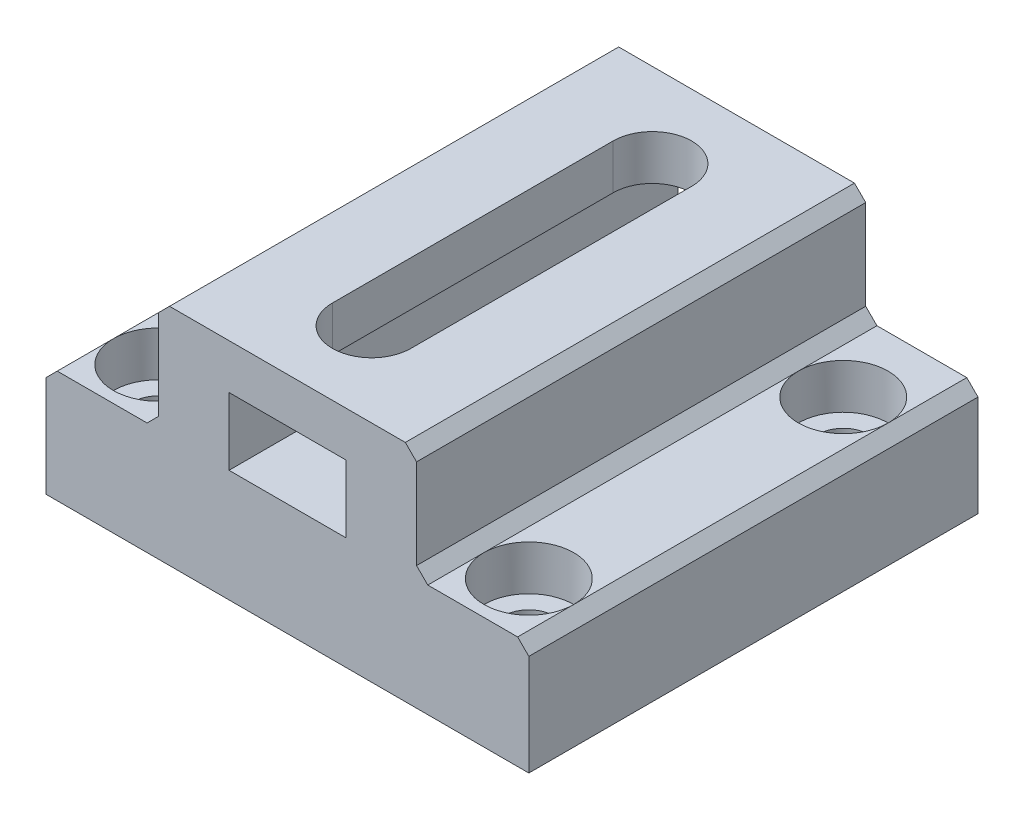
ISO-10303-21;
HEADER;
FILE_DESCRIPTION(('STEP AP214'),'2;1');
FILE_NAME('part.step','',(''),(''),'','','');
FILE_SCHEMA(('AUTOMOTIVE_DESIGN { 1 0 10303 214 1 1 1 1 }'));
ENDSEC;
DATA;
#1=APPLICATION_CONTEXT('core data for automotive mechanical design processes');
#2=APPLICATION_PROTOCOL_DEFINITION('international standard','automotive_design',2000,#1);
#3=PRODUCT_CONTEXT('',#1,'mechanical');
#4=PRODUCT('Part','Part','',(#3));
#5=PRODUCT_RELATED_PRODUCT_CATEGORY('part','',(#4));
#6=PRODUCT_DEFINITION_FORMATION('','',#4);
#7=PRODUCT_DEFINITION_CONTEXT('part definition',#1,'design');
#8=PRODUCT_DEFINITION('design','',#6,#7);
#9=PRODUCT_DEFINITION_SHAPE('','',#8);
#10=(LENGTH_UNIT() NAMED_UNIT(*) SI_UNIT(.MILLI.,.METRE.));
#11=(NAMED_UNIT(*) PLANE_ANGLE_UNIT() SI_UNIT($,.RADIAN.));
#12=(NAMED_UNIT(*) SI_UNIT($,.STERADIAN.) SOLID_ANGLE_UNIT());
#13=UNCERTAINTY_MEASURE_WITH_UNIT(LENGTH_MEASURE(1.E-05),#10,'distance_accuracy_value','');
#14=(GEOMETRIC_REPRESENTATION_CONTEXT(3) GLOBAL_UNCERTAINTY_ASSIGNED_CONTEXT((#13)) GLOBAL_UNIT_ASSIGNED_CONTEXT((#10,
#11,#12)) REPRESENTATION_CONTEXT('',''));
#15=CARTESIAN_POINT('',(0.,0.,0.));
#16=DIRECTION('',(0.,0.,1.));
#17=DIRECTION('',(1.,0.,0.));
#18=AXIS2_PLACEMENT_3D('',#15,#16,#17);
#19=CARTESIAN_POINT('',(21.5,10.,-20.));
#20=DIRECTION('',(0.,1.,0.));
#21=DIRECTION('',(-1.,0.,0.));
#22=AXIS2_PLACEMENT_3D('',#19,#20,#21);
#23=PLANE('',#22);
#24=DIRECTION('',(-1.,0.,0.));
#25=VECTOR('',#24,1.);
#26=CARTESIAN_POINT('',(21.5,10.,-20.));
#27=LINE('',#26,#25);
#28=CARTESIAN_POINT('',(20.5,10.,-20.));
#29=VERTEX_POINT('',#28);
#30=CARTESIAN_POINT('',(12.5,10.,-20.));
#31=VERTEX_POINT('',#30);
#32=EDGE_CURVE('E319',#29,#31,#27,.T.);
#33=ORIENTED_EDGE('',*,*,#32,.T.);
#34=DIRECTION('',(0.,0.,1.));
#35=VECTOR('',#34,1.);
#36=CARTESIAN_POINT('',(12.5,10.,20.));
#37=LINE('',#36,#35);
#38=CARTESIAN_POINT('',(12.5,10.,-13.));
#39=VERTEX_POINT('',#38);
#40=EDGE_CURVE('E433',#31,#39,#37,.T.);
#41=ORIENTED_EDGE('',*,*,#40,.T.);
#42=CARTESIAN_POINT('',(16.5,10.,-13.));
#43=DIRECTION('',(0.,1.,0.));
#44=DIRECTION('',(0.,0.,1.));
#45=AXIS2_PLACEMENT_3D('',#42,#43,#44);
#46=CIRCLE('',#45,4.);
#47=CARTESIAN_POINT('',(20.5,10.,-13.));
#48=VERTEX_POINT('',#47);
#49=EDGE_CURVE('E245',#48,#39,#46,.T.);
#50=ORIENTED_EDGE('',*,*,#49,.F.);
#51=DIRECTION('',(0.,0.,-1.));
#52=VECTOR('',#51,1.);
#53=CARTESIAN_POINT('',(20.5,10.,-20.));
#54=LINE('',#53,#52);
#55=EDGE_CURVE('E423',#48,#29,#54,.T.);
#56=ORIENTED_EDGE('',*,*,#55,.T.);
#57=EDGE_LOOP('',(#33,#41,#50,#56));
#58=FACE_BOUND('',#57,.T.);
#59=ADVANCED_FACE('F34',(#58),#23,.T.);
#60=EDGE_CURVE('E244',#39,#48,#46,.T.);
#61=ORIENTED_EDGE('',*,*,#60,.F.);
#62=DIRECTION('',(0.,0.,1.));
#63=VECTOR('',#62,1.);
#64=CARTESIAN_POINT('',(12.5,10.,20.));
#65=LINE('',#64,#63);
#66=CARTESIAN_POINT('',(12.5,10.,15.));
#67=VERTEX_POINT('',#66);
#68=EDGE_CURVE('E431',#39,#67,#65,.T.);
#69=ORIENTED_EDGE('',*,*,#68,.T.);
#70=CARTESIAN_POINT('',(16.5,10.,15.));
#71=DIRECTION('',(0.,1.,0.));
#72=DIRECTION('',(0.,0.,1.));
#73=AXIS2_PLACEMENT_3D('',#70,#71,#72);
#74=CIRCLE('',#73,4.);
#75=CARTESIAN_POINT('',(20.5,10.,15.));
#76=VERTEX_POINT('',#75);
#77=EDGE_CURVE('E271',#76,#67,#74,.T.);
#78=ORIENTED_EDGE('',*,*,#77,.F.);
#79=DIRECTION('',(0.,0.,-1.));
#80=VECTOR('',#79,1.);
#81=CARTESIAN_POINT('',(20.5,10.,-20.));
#82=LINE('',#81,#80);
#83=EDGE_CURVE('E425',#76,#48,#82,.T.);
#84=ORIENTED_EDGE('',*,*,#83,.T.);
#85=EDGE_LOOP('',(#61,#69,#78,#84));
#86=FACE_BOUND('',#85,.T.);
#87=ADVANCED_FACE('F545',(#86),#23,.T.);
#88=CARTESIAN_POINT('',(-21.5,10.,-20.));
#89=DIRECTION('',(0.,-1.,0.));
#90=DIRECTION('',(1.,0.,0.));
#91=AXIS2_PLACEMENT_3D('',#88,#89,#90);
#92=PLANE('',#91);
#93=DIRECTION('',(1.,0.,0.));
#94=VECTOR('',#93,1.);
#95=CARTESIAN_POINT('',(-21.5,10.,-20.));
#96=LINE('',#95,#94);
#97=CARTESIAN_POINT('',(-20.5,10.,-20.));
#98=VERTEX_POINT('',#97);
#99=CARTESIAN_POINT('',(-12.5,10.,-20.));
#100=VERTEX_POINT('',#99);
#101=EDGE_CURVE('E328',#98,#100,#96,.T.);
#102=ORIENTED_EDGE('',*,*,#101,.F.);
#103=DIRECTION('',(0.,0.,1.));
#104=VECTOR('',#103,1.);
#105=CARTESIAN_POINT('',(-20.5,10.,-20.));
#106=LINE('',#105,#104);
#107=CARTESIAN_POINT('',(-20.5,10.,-13.));
#108=VERTEX_POINT('',#107);
#109=EDGE_CURVE('E387',#98,#108,#106,.T.);
#110=ORIENTED_EDGE('',*,*,#109,.T.);
#111=CARTESIAN_POINT('',(-16.5,10.,-13.));
#112=DIRECTION('',(0.,1.,0.));
#113=DIRECTION('',(0.,0.,1.));
#114=AXIS2_PLACEMENT_3D('',#111,#112,#113);
#115=CIRCLE('',#114,4.);
#116=CARTESIAN_POINT('',(-12.5,10.,-13.));
#117=VERTEX_POINT('',#116);
#118=EDGE_CURVE('E232',#117,#108,#115,.T.);
#119=ORIENTED_EDGE('',*,*,#118,.F.);
#120=DIRECTION('',(0.,0.,-1.));
#121=VECTOR('',#120,1.);
#122=CARTESIAN_POINT('',(-12.5,10.,-20.));
#123=LINE('',#122,#121);
#124=EDGE_CURVE('E377',#117,#100,#123,.T.);
#125=ORIENTED_EDGE('',*,*,#124,.T.);
#126=EDGE_LOOP('',(#102,#110,#119,#125));
#127=FACE_BOUND('',#126,.T.);
#128=ADVANCED_FACE('F493',(#127),#92,.F.);
#129=EDGE_CURVE('E231',#108,#117,#115,.T.);
#130=ORIENTED_EDGE('',*,*,#129,.F.);
#131=DIRECTION('',(0.,0.,1.));
#132=VECTOR('',#131,1.);
#133=CARTESIAN_POINT('',(-20.5,10.,-20.));
#134=LINE('',#133,#132);
#135=CARTESIAN_POINT('',(-20.5,10.,15.));
#136=VERTEX_POINT('',#135);
#137=EDGE_CURVE('E385',#108,#136,#134,.T.);
#138=ORIENTED_EDGE('',*,*,#137,.T.);
#139=CARTESIAN_POINT('',(-16.5,10.,15.));
#140=DIRECTION('',(0.,1.,0.));
#141=DIRECTION('',(0.,0.,1.));
#142=AXIS2_PLACEMENT_3D('',#139,#140,#141);
#143=CIRCLE('',#142,4.);
#144=CARTESIAN_POINT('',(-12.5,10.,15.));
#145=VERTEX_POINT('',#144);
#146=EDGE_CURVE('E258',#145,#136,#143,.T.);
#147=ORIENTED_EDGE('',*,*,#146,.F.);
#148=DIRECTION('',(0.,0.,-1.));
#149=VECTOR('',#148,1.);
#150=CARTESIAN_POINT('',(-12.5,10.,-20.));
#151=LINE('',#150,#149);
#152=EDGE_CURVE('E379',#145,#117,#151,.T.);
#153=ORIENTED_EDGE('',*,*,#152,.T.);
#154=EDGE_LOOP('',(#130,#138,#147,#153));
#155=FACE_BOUND('',#154,.T.);
#156=ADVANCED_FACE('F526',(#155),#92,.F.);
#157=CARTESIAN_POINT('',(21.5,20.,-20.));
#158=DIRECTION('',(-1.,0.,0.));
#159=DIRECTION('',(0.,0.,1.));
#160=AXIS2_PLACEMENT_3D('',#157,#158,#159);
#161=PLANE('',#160);
#162=DIRECTION('',(0.,-1.,0.));
#163=VECTOR('',#162,1.);
#164=CARTESIAN_POINT('',(21.5,20.,-20.));
#165=LINE('',#164,#163);
#166=CARTESIAN_POINT('',(21.5,9.00000000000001,-20.));
#167=VERTEX_POINT('',#166);
#168=CARTESIAN_POINT('',(21.5,0.,-20.));
#169=VERTEX_POINT('',#168);
#170=EDGE_CURVE('E363',#167,#169,#165,.T.);
#171=ORIENTED_EDGE('',*,*,#170,.F.);
#172=DIRECTION('',(0.,0.,1.));
#173=VECTOR('',#172,1.);
#174=CARTESIAN_POINT('',(21.5,9.00000000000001,20.));
#175=LINE('',#174,#173);
#176=CARTESIAN_POINT('',(21.5,9.00000000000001,20.));
#177=VERTEX_POINT('',#176);
#178=EDGE_CURVE('E436',#167,#177,#175,.T.);
#179=ORIENTED_EDGE('',*,*,#178,.T.);
#180=DIRECTION('',(0.,-1.,0.));
#181=VECTOR('',#180,1.);
#182=CARTESIAN_POINT('',(21.5,20.,20.));
#183=LINE('',#182,#181);
#184=CARTESIAN_POINT('',(21.5,0.,20.));
#185=VERTEX_POINT('',#184);
#186=EDGE_CURVE('E347',#177,#185,#183,.T.);
#187=ORIENTED_EDGE('',*,*,#186,.T.);
#188=DIRECTION('',(0.,0.,-1.));
#189=VECTOR('',#188,1.);
#190=CARTESIAN_POINT('',(21.5,0.,-20.));
#191=LINE('',#190,#189);
#192=EDGE_CURVE('E335',#185,#169,#191,.T.);
#193=ORIENTED_EDGE('',*,*,#192,.T.);
#194=EDGE_LOOP('',(#171,#179,#187,#193));
#195=FACE_BOUND('',#194,.T.);
#196=ADVANCED_FACE('F471',(#195),#161,.F.);
#197=CARTESIAN_POINT('',(-21.5,20.,-20.));
#198=DIRECTION('',(0.,0.,1.));
#199=DIRECTION('',(1.,0.,0.));
#200=AXIS2_PLACEMENT_3D('',#197,#198,#199);
#201=PLANE('',#200);
#202=DIRECTION('',(-1.,0.,0.));
#203=VECTOR('',#202,1.);
#204=CARTESIAN_POINT('',(-21.5,0.,-20.));
#205=LINE('',#204,#203);
#206=CARTESIAN_POINT('',(-21.5,0.,-20.));
#207=VERTEX_POINT('',#206);
#208=EDGE_CURVE('E350',#169,#207,#205,.T.);
#209=ORIENTED_EDGE('',*,*,#208,.T.);
#210=DIRECTION('',(0.,-1.,0.));
#211=VECTOR('',#210,1.);
#212=CARTESIAN_POINT('',(-21.5,20.,-20.));
#213=LINE('',#212,#211);
#214=CARTESIAN_POINT('',(-21.5,9.00000000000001,-20.));
#215=VERTEX_POINT('',#214);
#216=EDGE_CURVE('E360',#215,#207,#213,.T.);
#217=ORIENTED_EDGE('',*,*,#216,.F.);
#218=DIRECTION('',(-0.707106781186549,-0.707106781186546,0.));
#219=VECTOR('',#218,1.);
#220=CARTESIAN_POINT('',(-20.5,10.,-20.));
#221=LINE('',#220,#219);
#222=EDGE_CURVE('E406',#215,#98,#221,.F.);
#223=ORIENTED_EDGE('',*,*,#222,.T.);
#224=ORIENTED_EDGE('',*,*,#101,.T.);
#225=DIRECTION('',(-0.707106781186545,-0.70710678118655,0.));
#226=VECTOR('',#225,1.);
#227=CARTESIAN_POINT('',(-12.,10.5,-20.));
#228=LINE('',#227,#226);
#229=CARTESIAN_POINT('',(-11.5,11.,-20.));
#230=VERTEX_POINT('',#229);
#231=EDGE_CURVE('E441',#100,#230,#228,.F.);
#232=ORIENTED_EDGE('',*,*,#231,.T.);
#233=DIRECTION('',(0.,1.,0.));
#234=VECTOR('',#233,1.);
#235=CARTESIAN_POINT('',(-11.5,20.,-20.));
#236=LINE('',#235,#234);
#237=CARTESIAN_POINT('',(-11.5,19.,-20.));
#238=VERTEX_POINT('',#237);
#239=EDGE_CURVE('E331',#230,#238,#236,.T.);
#240=ORIENTED_EDGE('',*,*,#239,.T.);
#241=DIRECTION('',(0.707106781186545,0.70710678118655,0.));
#242=VECTOR('',#241,1.);
#243=CARTESIAN_POINT('',(-10.5,20.,-20.));
#244=LINE('',#243,#242);
#245=CARTESIAN_POINT('',(-10.5,20.,-20.));
#246=VERTEX_POINT('',#245);
#247=EDGE_CURVE('E404',#238,#246,#244,.T.);
#248=ORIENTED_EDGE('',*,*,#247,.T.);
#249=DIRECTION('',(-1.,0.,0.));
#250=VECTOR('',#249,1.);
#251=CARTESIAN_POINT('',(-21.5,20.,-20.));
#252=LINE('',#251,#250);
#253=CARTESIAN_POINT('',(10.5,20.,-20.));
#254=VERTEX_POINT('',#253);
#255=EDGE_CURVE('E340',#254,#246,#252,.T.);
#256=ORIENTED_EDGE('',*,*,#255,.F.);
#257=DIRECTION('',(-0.707106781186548,0.707106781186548,0.));
#258=VECTOR('',#257,1.);
#259=CARTESIAN_POINT('',(11.5,19.,-20.));
#260=LINE('',#259,#258);
#261=CARTESIAN_POINT('',(11.5,19.,-20.));
#262=VERTEX_POINT('',#261);
#263=EDGE_CURVE('E402',#254,#262,#260,.F.);
#264=ORIENTED_EDGE('',*,*,#263,.T.);
#265=DIRECTION('',(0.,1.,0.));
#266=VECTOR('',#265,1.);
#267=CARTESIAN_POINT('',(11.5,20.,-20.));
#268=LINE('',#267,#266);
#269=CARTESIAN_POINT('',(11.5,11.,-20.));
#270=VERTEX_POINT('',#269);
#271=EDGE_CURVE('E316',#270,#262,#268,.T.);
#272=ORIENTED_EDGE('',*,*,#271,.F.);
#273=DIRECTION('',(-0.70710678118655,0.707106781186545,0.));
#274=VECTOR('',#273,1.);
#275=CARTESIAN_POINT('',(-9.50000000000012,32.,-20.));
#276=LINE('',#275,#274);
#277=EDGE_CURVE('E11',#270,#31,#276,.F.);
#278=ORIENTED_EDGE('',*,*,#277,.T.);
#279=ORIENTED_EDGE('',*,*,#32,.F.);
#280=DIRECTION('',(0.707106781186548,-0.707106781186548,0.));
#281=VECTOR('',#280,1.);
#282=CARTESIAN_POINT('',(21.5,9.00000000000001,-20.));
#283=LINE('',#282,#281);
#284=EDGE_CURVE('E400',#29,#167,#283,.T.);
#285=ORIENTED_EDGE('',*,*,#284,.T.);
#286=ORIENTED_EDGE('',*,*,#170,.T.);
#287=EDGE_LOOP('',(#209,#217,#223,#224,#232,#240,#248,#256,#264,#272,#278,#279,#285,#286));
#288=FACE_BOUND('',#287,.T.);
#289=DIRECTION('',(0.,-1.,0.));
#290=VECTOR('',#289,1.);
#291=CARTESIAN_POINT('',(-5.2,0.,-20.));
#292=LINE('',#291,#290);
#293=CARTESIAN_POINT('',(-5.2,16.,-20.));
#294=VERTEX_POINT('',#293);
#295=CARTESIAN_POINT('',(-5.2,10.,-20.));
#296=VERTEX_POINT('',#295);
#297=EDGE_CURVE('E303',#294,#296,#292,.T.);
#298=ORIENTED_EDGE('',*,*,#297,.T.);
#299=DIRECTION('',(-1.,0.,0.));
#300=VECTOR('',#299,1.);
#301=CARTESIAN_POINT('',(-5.20607799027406,10.,-20.));
#302=LINE('',#301,#300);
#303=CARTESIAN_POINT('',(5.2,10.,-20.));
#304=VERTEX_POINT('',#303);
#305=EDGE_CURVE('E224',#304,#296,#302,.T.);
#306=ORIENTED_EDGE('',*,*,#305,.F.);
#307=DIRECTION('',(0.,1.,0.));
#308=VECTOR('',#307,1.);
#309=CARTESIAN_POINT('',(5.2,0.,-20.));
#310=LINE('',#309,#308);
#311=CARTESIAN_POINT('',(5.2,16.,-20.));
#312=VERTEX_POINT('',#311);
#313=EDGE_CURVE('E220',#304,#312,#310,.T.);
#314=ORIENTED_EDGE('',*,*,#313,.T.);
#315=DIRECTION('',(-1.,0.,0.));
#316=VECTOR('',#315,1.);
#317=CARTESIAN_POINT('',(-5.2,16.,-20.));
#318=LINE('',#317,#316);
#319=EDGE_CURVE('E306',#312,#294,#318,.T.);
#320=ORIENTED_EDGE('',*,*,#319,.T.);
#321=EDGE_LOOP('',(#298,#306,#314,#320));
#322=FACE_BOUND('',#321,.T.);
#323=ADVANCED_FACE('F457',(#288,#322),#201,.F.);
#324=CARTESIAN_POINT('',(-21.5,20.,20.));
#325=DIRECTION('',(0.,0.,-1.));
#326=DIRECTION('',(-1.,0.,0.));
#327=AXIS2_PLACEMENT_3D('',#324,#325,#326);
#328=PLANE('',#327);
#329=DIRECTION('',(-1.,0.,0.));
#330=VECTOR('',#329,1.);
#331=CARTESIAN_POINT('',(-5.20607799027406,10.,20.));
#332=LINE('',#331,#330);
#333=CARTESIAN_POINT('',(5.2,10.,20.));
#334=VERTEX_POINT('',#333);
#335=CARTESIAN_POINT('',(-5.2,10.,20.));
#336=VERTEX_POINT('',#335);
#337=EDGE_CURVE('E210',#334,#336,#332,.T.);
#338=ORIENTED_EDGE('',*,*,#337,.T.);
#339=DIRECTION('',(0.,-1.,0.));
#340=VECTOR('',#339,1.);
#341=CARTESIAN_POINT('',(-5.2,0.,20.));
#342=LINE('',#341,#340);
#343=CARTESIAN_POINT('',(-5.2,16.,20.));
#344=VERTEX_POINT('',#343);
#345=EDGE_CURVE('E54',#344,#336,#342,.T.);
#346=ORIENTED_EDGE('',*,*,#345,.F.);
#347=DIRECTION('',(-1.,0.,0.));
#348=VECTOR('',#347,1.);
#349=CARTESIAN_POINT('',(-5.2,16.,20.));
#350=LINE('',#349,#348);
#351=CARTESIAN_POINT('',(5.2,16.,20.));
#352=VERTEX_POINT('',#351);
#353=EDGE_CURVE('E212',#352,#344,#350,.T.);
#354=ORIENTED_EDGE('',*,*,#353,.F.);
#355=DIRECTION('',(0.,1.,0.));
#356=VECTOR('',#355,1.);
#357=CARTESIAN_POINT('',(5.2,0.,20.));
#358=LINE('',#357,#356);
#359=EDGE_CURVE('E205',#334,#352,#358,.T.);
#360=ORIENTED_EDGE('',*,*,#359,.F.);
#361=EDGE_LOOP('',(#338,#346,#354,#360));
#362=FACE_BOUND('',#361,.T.);
#363=DIRECTION('',(1.,0.,0.));
#364=VECTOR('',#363,1.);
#365=CARTESIAN_POINT('',(-21.5,0.,20.));
#366=LINE('',#365,#364);
#367=CARTESIAN_POINT('',(-21.5,0.,20.));
#368=VERTEX_POINT('',#367);
#369=EDGE_CURVE('E344',#368,#185,#366,.T.);
#370=ORIENTED_EDGE('',*,*,#369,.T.);
#371=ORIENTED_EDGE('',*,*,#186,.F.);
#372=DIRECTION('',(-0.707106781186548,0.707106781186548,0.));
#373=VECTOR('',#372,1.);
#374=CARTESIAN_POINT('',(21.5,9.00000000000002,20.));
#375=LINE('',#374,#373);
#376=CARTESIAN_POINT('',(20.5,10.,20.));
#377=VERTEX_POINT('',#376);
#378=EDGE_CURVE('E390',#177,#377,#375,.T.);
#379=ORIENTED_EDGE('',*,*,#378,.T.);
#380=DIRECTION('',(-1.,0.,0.));
#381=VECTOR('',#380,1.);
#382=CARTESIAN_POINT('',(21.5,10.,20.));
#383=LINE('',#382,#381);
#384=CARTESIAN_POINT('',(12.5,10.,20.));
#385=VERTEX_POINT('',#384);
#386=EDGE_CURVE('E320',#377,#385,#383,.T.);
#387=ORIENTED_EDGE('',*,*,#386,.T.);
#388=DIRECTION('',(0.70710678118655,-0.707106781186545,0.));
#389=VECTOR('',#388,1.);
#390=CARTESIAN_POINT('',(-9.50000000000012,32.,20.));
#391=LINE('',#390,#389);
#392=CARTESIAN_POINT('',(11.5,11.,20.));
#393=VERTEX_POINT('',#392);
#394=EDGE_CURVE('E42',#385,#393,#391,.F.);
#395=ORIENTED_EDGE('',*,*,#394,.T.);
#396=DIRECTION('',(0.,1.,0.));
#397=VECTOR('',#396,1.);
#398=CARTESIAN_POINT('',(11.5,20.,20.));
#399=LINE('',#398,#397);
#400=CARTESIAN_POINT('',(11.5,19.,20.));
#401=VERTEX_POINT('',#400);
#402=EDGE_CURVE('E314',#393,#401,#399,.T.);
#403=ORIENTED_EDGE('',*,*,#402,.T.);
#404=DIRECTION('',(0.707106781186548,-0.707106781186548,0.));
#405=VECTOR('',#404,1.);
#406=CARTESIAN_POINT('',(11.5,19.,20.));
#407=LINE('',#406,#405);
#408=CARTESIAN_POINT('',(10.5,20.,20.));
#409=VERTEX_POINT('',#408);
#410=EDGE_CURVE('E392',#401,#409,#407,.F.);
#411=ORIENTED_EDGE('',*,*,#410,.T.);
#412=DIRECTION('',(1.,0.,0.));
#413=VECTOR('',#412,1.);
#414=CARTESIAN_POINT('',(-21.5,20.,20.));
#415=LINE('',#414,#413);
#416=CARTESIAN_POINT('',(-10.5,20.,20.));
#417=VERTEX_POINT('',#416);
#418=EDGE_CURVE('E343',#417,#409,#415,.T.);
#419=ORIENTED_EDGE('',*,*,#418,.F.);
#420=DIRECTION('',(-0.707106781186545,-0.70710678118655,0.));
#421=VECTOR('',#420,1.);
#422=CARTESIAN_POINT('',(-10.5,20.,20.));
#423=LINE('',#422,#421);
#424=CARTESIAN_POINT('',(-11.5,19.,20.));
#425=VERTEX_POINT('',#424);
#426=EDGE_CURVE('E394',#417,#425,#423,.T.);
#427=ORIENTED_EDGE('',*,*,#426,.T.);
#428=DIRECTION('',(0.,1.,0.));
#429=VECTOR('',#428,1.);
#430=CARTESIAN_POINT('',(-11.5,20.,20.));
#431=LINE('',#430,#429);
#432=CARTESIAN_POINT('',(-11.5,11.,20.));
#433=VERTEX_POINT('',#432);
#434=EDGE_CURVE('E332',#433,#425,#431,.T.);
#435=ORIENTED_EDGE('',*,*,#434,.F.);
#436=DIRECTION('',(0.707106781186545,0.70710678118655,0.));
#437=VECTOR('',#436,1.);
#438=CARTESIAN_POINT('',(-12.,10.5,20.));
#439=LINE('',#438,#437);
#440=CARTESIAN_POINT('',(-12.5,10.,20.));
#441=VERTEX_POINT('',#440);
#442=EDGE_CURVE('E439',#433,#441,#439,.F.);
#443=ORIENTED_EDGE('',*,*,#442,.T.);
#444=DIRECTION('',(1.,0.,0.));
#445=VECTOR('',#444,1.);
#446=CARTESIAN_POINT('',(-21.5,10.,20.));
#447=LINE('',#446,#445);
#448=CARTESIAN_POINT('',(-20.5,10.,20.));
#449=VERTEX_POINT('',#448);
#450=EDGE_CURVE('E323',#449,#441,#447,.T.);
#451=ORIENTED_EDGE('',*,*,#450,.F.);
#452=DIRECTION('',(0.707106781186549,0.707106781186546,0.));
#453=VECTOR('',#452,1.);
#454=CARTESIAN_POINT('',(-20.5,10.,20.));
#455=LINE('',#454,#453);
#456=CARTESIAN_POINT('',(-21.5,9.00000000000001,20.));
#457=VERTEX_POINT('',#456);
#458=EDGE_CURVE('E396',#449,#457,#455,.F.);
#459=ORIENTED_EDGE('',*,*,#458,.T.);
#460=DIRECTION('',(0.,-1.,0.));
#461=VECTOR('',#460,1.);
#462=CARTESIAN_POINT('',(-21.5,20.,20.));
#463=LINE('',#462,#461);
#464=EDGE_CURVE('E358',#457,#368,#463,.T.);
#465=ORIENTED_EDGE('',*,*,#464,.T.);
#466=EDGE_LOOP('',(#370,#371,#379,#387,#395,#403,#411,#419,#427,#435,#443,#451,#459,#465));
#467=FACE_BOUND('',#466,.T.);
#468=ADVANCED_FACE('F207',(#362,#467),#328,.F.);
#469=CARTESIAN_POINT('',(0.,20.,0.));
#470=DIRECTION('',(0.,1.,0.));
#471=DIRECTION('',(0.,0.,1.));
#472=AXIS2_PLACEMENT_3D('',#469,#470,#471);
#473=PLANE('',#472);
#474=CARTESIAN_POINT('',(0.,20.,12.5));
#475=DIRECTION('',(0.,1.,0.));
#476=DIRECTION('',(0.,0.,1.));
#477=AXIS2_PLACEMENT_3D('',#474,#475,#476);
#478=CIRCLE('',#477,3.5);
#479=CARTESIAN_POINT('',(-3.5,20.,12.5));
#480=VERTEX_POINT('',#479);
#481=CARTESIAN_POINT('',(3.5,20.,12.5));
#482=VERTEX_POINT('',#481);
#483=EDGE_CURVE('E283',#480,#482,#478,.T.);
#484=ORIENTED_EDGE('',*,*,#483,.F.);
#485=DIRECTION('',(0.,0.,1.));
#486=VECTOR('',#485,1.);
#487=CARTESIAN_POINT('',(-3.5,20.,12.5));
#488=LINE('',#487,#486);
#489=CARTESIAN_POINT('',(-3.5,20.,-12.5));
#490=VERTEX_POINT('',#489);
#491=EDGE_CURVE('E291',#490,#480,#488,.T.);
#492=ORIENTED_EDGE('',*,*,#491,.F.);
#493=CARTESIAN_POINT('',(0.,20.,-12.5));
#494=DIRECTION('',(0.,1.,0.));
#495=DIRECTION('',(0.,0.,1.));
#496=AXIS2_PLACEMENT_3D('',#493,#494,#495);
#497=CIRCLE('',#496,3.5);
#498=CARTESIAN_POINT('',(3.5,20.,-12.5));
#499=VERTEX_POINT('',#498);
#500=EDGE_CURVE('E288',#499,#490,#497,.T.);
#501=ORIENTED_EDGE('',*,*,#500,.F.);
#502=DIRECTION('',(0.,0.,-1.));
#503=VECTOR('',#502,1.);
#504=CARTESIAN_POINT('',(3.5,20.,12.5));
#505=LINE('',#504,#503);
#506=EDGE_CURVE('E285',#482,#499,#505,.T.);
#507=ORIENTED_EDGE('',*,*,#506,.F.);
#508=EDGE_LOOP('',(#484,#492,#501,#507));
#509=FACE_BOUND('',#508,.T.);
#510=ORIENTED_EDGE('',*,*,#255,.T.);
#511=DIRECTION('',(0.,0.,1.));
#512=VECTOR('',#511,1.);
#513=CARTESIAN_POINT('',(-10.5,20.,20.));
#514=LINE('',#513,#512);
#515=EDGE_CURVE('E415',#246,#417,#514,.T.);
#516=ORIENTED_EDGE('',*,*,#515,.T.);
#517=ORIENTED_EDGE('',*,*,#418,.T.);
#518=DIRECTION('',(0.,0.,-1.));
#519=VECTOR('',#518,1.);
#520=CARTESIAN_POINT('',(10.5,20.,0.));
#521=LINE('',#520,#519);
#522=EDGE_CURVE('E413',#409,#254,#521,.T.);
#523=ORIENTED_EDGE('',*,*,#522,.T.);
#524=EDGE_LOOP('',(#510,#516,#517,#523));
#525=FACE_BOUND('',#524,.T.);
#526=ADVANCED_FACE('F514',(#509,#525),#473,.T.);
#527=CARTESIAN_POINT('',(-21.5,20.,-20.));
#528=DIRECTION('',(1.,0.,0.));
#529=DIRECTION('',(0.,0.,-1.));
#530=AXIS2_PLACEMENT_3D('',#527,#528,#529);
#531=PLANE('',#530);
#532=ORIENTED_EDGE('',*,*,#464,.F.);
#533=DIRECTION('',(0.,0.,-1.));
#534=VECTOR('',#533,1.);
#535=CARTESIAN_POINT('',(-21.5,9.00000000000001,-20.));
#536=LINE('',#535,#534);
#537=EDGE_CURVE('E398',#457,#215,#536,.T.);
#538=ORIENTED_EDGE('',*,*,#537,.T.);
#539=ORIENTED_EDGE('',*,*,#216,.T.);
#540=DIRECTION('',(0.,0.,1.));
#541=VECTOR('',#540,1.);
#542=CARTESIAN_POINT('',(-21.5,0.,-20.));
#543=LINE('',#542,#541);
#544=EDGE_CURVE('E352',#207,#368,#543,.T.);
#545=ORIENTED_EDGE('',*,*,#544,.T.);
#546=EDGE_LOOP('',(#532,#538,#539,#545));
#547=FACE_BOUND('',#546,.T.);
#548=ADVANCED_FACE('F483',(#547),#531,.F.);
#549=CARTESIAN_POINT('',(0.,0.,0.));
#550=DIRECTION('',(0.,1.,0.));
#551=DIRECTION('',(0.,0.,1.));
#552=AXIS2_PLACEMENT_3D('',#549,#550,#551);
#553=PLANE('',#552);
#554=CARTESIAN_POINT('',(16.5,0.,-13.));
#555=DIRECTION('',(0.,1.,0.));
#556=DIRECTION('',(0.,0.,1.));
#557=AXIS2_PLACEMENT_3D('',#554,#555,#556);
#558=CIRCLE('',#557,2.25);
#559=CARTESIAN_POINT('',(16.5,0.,-10.75));
#560=VERTEX_POINT('',#559);
#561=EDGE_CURVE('E254',#560,#560,#558,.T.);
#562=ORIENTED_EDGE('',*,*,#561,.T.);
#563=EDGE_LOOP('',(#562));
#564=FACE_BOUND('',#563,.T.);
#565=CARTESIAN_POINT('',(16.5,0.,15.));
#566=DIRECTION('',(0.,1.,0.));
#567=DIRECTION('',(0.,0.,1.));
#568=AXIS2_PLACEMENT_3D('',#565,#566,#567);
#569=CIRCLE('',#568,2.25);
#570=CARTESIAN_POINT('',(16.5,0.,17.25));
#571=VERTEX_POINT('',#570);
#572=EDGE_CURVE('E280',#571,#571,#569,.T.);
#573=ORIENTED_EDGE('',*,*,#572,.T.);
#574=EDGE_LOOP('',(#573));
#575=FACE_BOUND('',#574,.T.);
#576=ORIENTED_EDGE('',*,*,#192,.F.);
#577=ORIENTED_EDGE('',*,*,#369,.F.);
#578=ORIENTED_EDGE('',*,*,#544,.F.);
#579=ORIENTED_EDGE('',*,*,#208,.F.);
#580=EDGE_LOOP('',(#576,#577,#578,#579));
#581=FACE_BOUND('',#580,.T.);
#582=CARTESIAN_POINT('',(-16.5,0.,-13.));
#583=DIRECTION('',(0.,1.,0.));
#584=DIRECTION('',(0.,0.,1.));
#585=AXIS2_PLACEMENT_3D('',#582,#583,#584);
#586=CIRCLE('',#585,2.25);
#587=CARTESIAN_POINT('',(-16.5,0.,-10.75));
#588=VERTEX_POINT('',#587);
#589=EDGE_CURVE('E241',#588,#588,#586,.T.);
#590=ORIENTED_EDGE('',*,*,#589,.T.);
#591=EDGE_LOOP('',(#590));
#592=FACE_BOUND('',#591,.T.);
#593=CARTESIAN_POINT('',(-16.5,0.,15.));
#594=DIRECTION('',(0.,1.,0.));
#595=DIRECTION('',(0.,0.,1.));
#596=AXIS2_PLACEMENT_3D('',#593,#594,#595);
#597=CIRCLE('',#596,2.25);
#598=CARTESIAN_POINT('',(-16.5,0.,17.25));
#599=VERTEX_POINT('',#598);
#600=EDGE_CURVE('E267',#599,#599,#597,.T.);
#601=ORIENTED_EDGE('',*,*,#600,.T.);
#602=EDGE_LOOP('',(#601));
#603=FACE_BOUND('',#602,.T.);
#604=ADVANCED_FACE('F476',(#564,#575,#581,#592,#603),#553,.F.);
#605=CARTESIAN_POINT('',(-11.5,20.,-20.));
#606=DIRECTION('',(1.,0.,0.));
#607=DIRECTION('',(0.,1.,0.));
#608=AXIS2_PLACEMENT_3D('',#605,#606,#607);
#609=PLANE('',#608);
#610=ORIENTED_EDGE('',*,*,#239,.F.);
#611=DIRECTION('',(0.,0.,1.));
#612=VECTOR('',#611,1.);
#613=CARTESIAN_POINT('',(-11.5,11.,20.));
#614=LINE('',#613,#612);
#615=EDGE_CURVE('E410',#230,#433,#614,.T.);
#616=ORIENTED_EDGE('',*,*,#615,.T.);
#617=ORIENTED_EDGE('',*,*,#434,.T.);
#618=DIRECTION('',(0.,0.,-1.));
#619=VECTOR('',#618,1.);
#620=CARTESIAN_POINT('',(-11.5,19.,-20.));
#621=LINE('',#620,#619);
#622=EDGE_CURVE('E408',#425,#238,#621,.T.);
#623=ORIENTED_EDGE('',*,*,#622,.T.);
#624=EDGE_LOOP('',(#610,#616,#617,#623));
#625=FACE_BOUND('',#624,.T.);
#626=ADVANCED_FACE('F505',(#625),#609,.F.);
#627=EDGE_CURVE('E257',#136,#145,#143,.T.);
#628=ORIENTED_EDGE('',*,*,#627,.F.);
#629=DIRECTION('',(0.,0.,1.));
#630=VECTOR('',#629,1.);
#631=CARTESIAN_POINT('',(-20.5,10.,-20.));
#632=LINE('',#631,#630);
#633=EDGE_CURVE('E383',#136,#449,#632,.T.);
#634=ORIENTED_EDGE('',*,*,#633,.T.);
#635=ORIENTED_EDGE('',*,*,#450,.T.);
#636=DIRECTION('',(0.,0.,-1.));
#637=VECTOR('',#636,1.);
#638=CARTESIAN_POINT('',(-12.5,10.,-20.));
#639=LINE('',#638,#637);
#640=EDGE_CURVE('E381',#441,#145,#639,.T.);
#641=ORIENTED_EDGE('',*,*,#640,.T.);
#642=EDGE_LOOP('',(#628,#634,#635,#641));
#643=FACE_BOUND('',#642,.T.);
#644=ADVANCED_FACE('F522',(#643),#92,.F.);
#645=EDGE_CURVE('E270',#67,#76,#74,.T.);
#646=ORIENTED_EDGE('',*,*,#645,.F.);
#647=DIRECTION('',(0.,0.,1.));
#648=VECTOR('',#647,1.);
#649=CARTESIAN_POINT('',(12.5,10.,20.));
#650=LINE('',#649,#648);
#651=EDGE_CURVE('E429',#67,#385,#650,.T.);
#652=ORIENTED_EDGE('',*,*,#651,.T.);
#653=ORIENTED_EDGE('',*,*,#386,.F.);
#654=DIRECTION('',(0.,0.,-1.));
#655=VECTOR('',#654,1.);
#656=CARTESIAN_POINT('',(20.5,10.,-20.));
#657=LINE('',#656,#655);
#658=EDGE_CURVE('E427',#377,#76,#657,.T.);
#659=ORIENTED_EDGE('',*,*,#658,.T.);
#660=EDGE_LOOP('',(#646,#652,#653,#659));
#661=FACE_BOUND('',#660,.T.);
#662=ADVANCED_FACE('F547',(#661),#23,.T.);
#663=CARTESIAN_POINT('',(11.5,20.,-20.));
#664=DIRECTION('',(1.,0.,0.));
#665=DIRECTION('',(0.,1.,0.));
#666=AXIS2_PLACEMENT_3D('',#663,#664,#665);
#667=PLANE('',#666);
#668=ORIENTED_EDGE('',*,*,#271,.T.);
#669=DIRECTION('',(0.,0.,1.));
#670=VECTOR('',#669,1.);
#671=CARTESIAN_POINT('',(11.5,19.,-20.));
#672=LINE('',#671,#670);
#673=EDGE_CURVE('E420',#262,#401,#672,.T.);
#674=ORIENTED_EDGE('',*,*,#673,.T.);
#675=ORIENTED_EDGE('',*,*,#402,.F.);
#676=DIRECTION('',(0.,0.,-1.));
#677=VECTOR('',#676,1.);
#678=CARTESIAN_POINT('',(11.5,11.,-20.));
#679=LINE('',#678,#677);
#680=EDGE_CURVE('E418',#393,#270,#679,.T.);
#681=ORIENTED_EDGE('',*,*,#680,.T.);
#682=EDGE_LOOP('',(#668,#674,#675,#681));
#683=FACE_BOUND('',#682,.T.);
#684=ADVANCED_FACE('F449',(#683),#667,.T.);
#685=CARTESIAN_POINT('',(-5.2,0.,-20.));
#686=DIRECTION('',(-1.,0.,0.));
#687=DIRECTION('',(0.,-1.,0.));
#688=AXIS2_PLACEMENT_3D('',#685,#686,#687);
#689=PLANE('',#688);
#690=ORIENTED_EDGE('',*,*,#345,.T.);
#691=DIRECTION('',(0.,0.,-1.));
#692=VECTOR('',#691,1.);
#693=CARTESIAN_POINT('',(-5.2,10.,-20.));
#694=LINE('',#693,#692);
#695=EDGE_CURVE('E49',#336,#296,#694,.T.);
#696=ORIENTED_EDGE('',*,*,#695,.T.);
#697=ORIENTED_EDGE('',*,*,#297,.F.);
#698=DIRECTION('',(0.,0.,1.));
#699=VECTOR('',#698,1.);
#700=CARTESIAN_POINT('',(-5.2,16.,-20.));
#701=LINE('',#700,#699);
#702=EDGE_CURVE('E312',#294,#344,#701,.T.);
#703=ORIENTED_EDGE('',*,*,#702,.T.);
#704=EDGE_LOOP('',(#690,#696,#697,#703));
#705=FACE_BOUND('',#704,.T.);
#706=ADVANCED_FACE('F560',(#705),#689,.F.);
#707=CARTESIAN_POINT('',(-5.2,16.,-20.));
#708=DIRECTION('',(0.,1.,0.));
#709=DIRECTION('',(0.,0.,1.));
#710=AXIS2_PLACEMENT_3D('',#707,#708,#709);
#711=PLANE('',#710);
#712=DIRECTION('',(0.,0.,1.));
#713=VECTOR('',#712,1.);
#714=CARTESIAN_POINT('',(-3.5,16.,-20.));
#715=LINE('',#714,#713);
#716=CARTESIAN_POINT('',(-3.5,16.,-12.5));
#717=VERTEX_POINT('',#716);
#718=CARTESIAN_POINT('',(-3.5,16.,12.5));
#719=VERTEX_POINT('',#718);
#720=EDGE_CURVE('E371',#717,#719,#715,.T.);
#721=ORIENTED_EDGE('',*,*,#720,.T.);
#722=CARTESIAN_POINT('',(0.,16.,12.5));
#723=DIRECTION('',(0.,1.,0.));
#724=DIRECTION('',(0.,0.,1.));
#725=AXIS2_PLACEMENT_3D('',#722,#723,#724);
#726=CIRCLE('',#725,3.5);
#727=CARTESIAN_POINT('',(3.5,16.,12.5));
#728=VERTEX_POINT('',#727);
#729=EDGE_CURVE('E374',#719,#728,#726,.T.);
#730=ORIENTED_EDGE('',*,*,#729,.T.);
#731=DIRECTION('',(0.,0.,-1.));
#732=VECTOR('',#731,1.);
#733=CARTESIAN_POINT('',(3.5,16.,-20.));
#734=LINE('',#733,#732);
#735=CARTESIAN_POINT('',(3.5,16.,-12.5));
#736=VERTEX_POINT('',#735);
#737=EDGE_CURVE('E365',#728,#736,#734,.T.);
#738=ORIENTED_EDGE('',*,*,#737,.T.);
#739=CARTESIAN_POINT('',(0.,16.,-12.5));
#740=DIRECTION('',(0.,1.,0.));
#741=DIRECTION('',(0.,0.,1.));
#742=AXIS2_PLACEMENT_3D('',#739,#740,#741);
#743=CIRCLE('',#742,3.5);
#744=EDGE_CURVE('E368',#736,#717,#743,.T.);
#745=ORIENTED_EDGE('',*,*,#744,.T.);
#746=EDGE_LOOP('',(#721,#730,#738,#745));
#747=FACE_BOUND('',#746,.T.);
#748=ORIENTED_EDGE('',*,*,#353,.T.);
#749=ORIENTED_EDGE('',*,*,#702,.F.);
#750=ORIENTED_EDGE('',*,*,#319,.F.);
#751=DIRECTION('',(0.,0.,1.));
#752=VECTOR('',#751,1.);
#753=CARTESIAN_POINT('',(5.2,16.,-20.));
#754=LINE('',#753,#752);
#755=EDGE_CURVE('E309',#312,#352,#754,.T.);
#756=ORIENTED_EDGE('',*,*,#755,.T.);
#757=EDGE_LOOP('',(#748,#749,#750,#756));
#758=FACE_BOUND('',#757,.T.);
#759=ADVANCED_FACE('F627',(#747,#758),#711,.F.);
#760=CARTESIAN_POINT('',(5.2,0.,-20.));
#761=DIRECTION('',(1.,0.,0.));
#762=DIRECTION('',(0.,0.,-1.));
#763=AXIS2_PLACEMENT_3D('',#760,#761,#762);
#764=PLANE('',#763);
#765=ORIENTED_EDGE('',*,*,#313,.F.);
#766=DIRECTION('',(0.,0.,1.));
#767=VECTOR('',#766,1.);
#768=CARTESIAN_POINT('',(5.2,10.,-20.));
#769=LINE('',#768,#767);
#770=EDGE_CURVE('E218',#304,#334,#769,.T.);
#771=ORIENTED_EDGE('',*,*,#770,.T.);
#772=ORIENTED_EDGE('',*,*,#359,.T.);
#773=ORIENTED_EDGE('',*,*,#755,.F.);
#774=EDGE_LOOP('',(#765,#771,#772,#773));
#775=FACE_BOUND('',#774,.T.);
#776=ADVANCED_FACE('F219',(#775),#764,.F.);
#777=CARTESIAN_POINT('',(0.,0.,12.5));
#778=DIRECTION('',(0.,1.,0.));
#779=DIRECTION('',(0.,0.,1.));
#780=AXIS2_PLACEMENT_3D('',#777,#778,#779);
#781=CYLINDRICAL_SURFACE('',#780,3.5);
#782=DIRECTION('',(0.,1.,0.));
#783=VECTOR('',#782,1.);
#784=CARTESIAN_POINT('',(-3.5,0.,12.5));
#785=LINE('',#784,#783);
#786=EDGE_CURVE('E295',#719,#480,#785,.T.);
#787=ORIENTED_EDGE('',*,*,#786,.T.);
#788=ORIENTED_EDGE('',*,*,#483,.T.);
#789=DIRECTION('',(0.,1.,0.));
#790=VECTOR('',#789,1.);
#791=CARTESIAN_POINT('',(3.5,0.,12.5));
#792=LINE('',#791,#790);
#793=EDGE_CURVE('E294',#728,#482,#792,.T.);
#794=ORIENTED_EDGE('',*,*,#793,.F.);
#795=ORIENTED_EDGE('',*,*,#729,.F.);
#796=EDGE_LOOP('',(#787,#788,#794,#795));
#797=FACE_BOUND('',#796,.T.);
#798=ADVANCED_FACE('F616',(#797),#781,.F.);
#799=CARTESIAN_POINT('',(-3.5,0.,12.5));
#800=DIRECTION('',(-1.,0.,0.));
#801=DIRECTION('',(0.,0.,1.));
#802=AXIS2_PLACEMENT_3D('',#799,#800,#801);
#803=PLANE('',#802);
#804=DIRECTION('',(0.,1.,0.));
#805=VECTOR('',#804,1.);
#806=CARTESIAN_POINT('',(-3.5,0.,-12.5));
#807=LINE('',#806,#805);
#808=EDGE_CURVE('E297',#717,#490,#807,.T.);
#809=ORIENTED_EDGE('',*,*,#808,.T.);
#810=ORIENTED_EDGE('',*,*,#491,.T.);
#811=ORIENTED_EDGE('',*,*,#786,.F.);
#812=ORIENTED_EDGE('',*,*,#720,.F.);
#813=EDGE_LOOP('',(#809,#810,#811,#812));
#814=FACE_BOUND('',#813,.T.);
#815=ADVANCED_FACE('F612',(#814),#803,.F.);
#816=CARTESIAN_POINT('',(0.,0.,-12.5));
#817=DIRECTION('',(0.,1.,0.));
#818=DIRECTION('',(0.,0.,1.));
#819=AXIS2_PLACEMENT_3D('',#816,#817,#818);
#820=CYLINDRICAL_SURFACE('',#819,3.5);
#821=DIRECTION('',(0.,1.,0.));
#822=VECTOR('',#821,1.);
#823=CARTESIAN_POINT('',(3.5,0.,-12.5));
#824=LINE('',#823,#822);
#825=EDGE_CURVE('E299',#736,#499,#824,.T.);
#826=ORIENTED_EDGE('',*,*,#825,.T.);
#827=ORIENTED_EDGE('',*,*,#500,.T.);
#828=ORIENTED_EDGE('',*,*,#808,.F.);
#829=ORIENTED_EDGE('',*,*,#744,.F.);
#830=EDGE_LOOP('',(#826,#827,#828,#829));
#831=FACE_BOUND('',#830,.T.);
#832=ADVANCED_FACE('F615',(#831),#820,.F.);
#833=CARTESIAN_POINT('',(3.5,0.,12.5));
#834=DIRECTION('',(1.,0.,0.));
#835=DIRECTION('',(0.,0.,-1.));
#836=AXIS2_PLACEMENT_3D('',#833,#834,#835);
#837=PLANE('',#836);
#838=ORIENTED_EDGE('',*,*,#793,.T.);
#839=ORIENTED_EDGE('',*,*,#506,.T.);
#840=ORIENTED_EDGE('',*,*,#825,.F.);
#841=ORIENTED_EDGE('',*,*,#737,.F.);
#842=EDGE_LOOP('',(#838,#839,#840,#841));
#843=FACE_BOUND('',#842,.T.);
#844=ADVANCED_FACE('F610',(#843),#837,.F.);
#845=CARTESIAN_POINT('',(16.5,10.,15.));
#846=DIRECTION('',(0.,1.,0.));
#847=DIRECTION('',(0.,0.,1.));
#848=AXIS2_PLACEMENT_3D('',#845,#846,#847);
#849=CYLINDRICAL_SURFACE('',#848,2.25);
#850=ORIENTED_EDGE('',*,*,#572,.F.);
#851=EDGE_LOOP('',(#850));
#852=FACE_BOUND('',#851,.T.);
#853=CARTESIAN_POINT('',(16.5,6.,15.));
#854=DIRECTION('',(0.,1.,0.));
#855=DIRECTION('',(0.,0.,1.));
#856=AXIS2_PLACEMENT_3D('',#853,#854,#855);
#857=CIRCLE('',#856,2.25);
#858=CARTESIAN_POINT('',(16.5,6.,17.25));
#859=VERTEX_POINT('',#858);
#860=EDGE_CURVE('E277',#859,#859,#857,.T.);
#861=ORIENTED_EDGE('',*,*,#860,.T.);
#862=EDGE_LOOP('',(#861));
#863=FACE_BOUND('',#862,.T.);
#864=ADVANCED_FACE('F606',(#852,#863),#849,.F.);
#865=CARTESIAN_POINT('',(18.75,6.,15.));
#866=DIRECTION('',(0.,-1.,0.));
#867=DIRECTION('',(0.,0.,-1.));
#868=AXIS2_PLACEMENT_3D('',#865,#866,#867);
#869=PLANE('',#868);
#870=ORIENTED_EDGE('',*,*,#860,.F.);
#871=EDGE_LOOP('',(#870));
#872=FACE_BOUND('',#871,.T.);
#873=CARTESIAN_POINT('',(16.5,6.,15.));
#874=DIRECTION('',(0.,1.,0.));
#875=DIRECTION('',(0.,0.,1.));
#876=AXIS2_PLACEMENT_3D('',#873,#874,#875);
#877=CIRCLE('',#876,4.);
#878=CARTESIAN_POINT('',(16.5,6.,19.));
#879=VERTEX_POINT('',#878);
#880=EDGE_CURVE('E274',#879,#879,#877,.T.);
#881=ORIENTED_EDGE('',*,*,#880,.T.);
#882=EDGE_LOOP('',(#881));
#883=FACE_BOUND('',#882,.T.);
#884=ADVANCED_FACE('F602',(#872,#883),#869,.F.);
#885=CARTESIAN_POINT('',(16.5,10.,15.));
#886=DIRECTION('',(0.,1.,0.));
#887=DIRECTION('',(0.,0.,1.));
#888=AXIS2_PLACEMENT_3D('',#885,#886,#887);
#889=CYLINDRICAL_SURFACE('',#888,4.);
#890=ORIENTED_EDGE('',*,*,#880,.F.);
#891=EDGE_LOOP('',(#890));
#892=FACE_BOUND('',#891,.T.);
#893=ORIENTED_EDGE('',*,*,#77,.T.);
#894=ORIENTED_EDGE('',*,*,#645,.T.);
#895=EDGE_LOOP('',(#893,#894));
#896=FACE_BOUND('',#895,.T.);
#897=ADVANCED_FACE('F566',(#892,#896),#889,.F.);
#898=CARTESIAN_POINT('',(-16.5,10.,15.));
#899=DIRECTION('',(0.,1.,0.));
#900=DIRECTION('',(0.,0.,1.));
#901=AXIS2_PLACEMENT_3D('',#898,#899,#900);
#902=CYLINDRICAL_SURFACE('',#901,2.25);
#903=ORIENTED_EDGE('',*,*,#600,.F.);
#904=EDGE_LOOP('',(#903));
#905=FACE_BOUND('',#904,.T.);
#906=CARTESIAN_POINT('',(-16.5,6.,15.));
#907=DIRECTION('',(0.,1.,0.));
#908=DIRECTION('',(0.,0.,1.));
#909=AXIS2_PLACEMENT_3D('',#906,#907,#908);
#910=CIRCLE('',#909,2.25);
#911=CARTESIAN_POINT('',(-16.5,6.,17.25));
#912=VERTEX_POINT('',#911);
#913=EDGE_CURVE('E264',#912,#912,#910,.T.);
#914=ORIENTED_EDGE('',*,*,#913,.T.);
#915=EDGE_LOOP('',(#914));
#916=FACE_BOUND('',#915,.T.);
#917=ADVANCED_FACE('F595',(#905,#916),#902,.F.);
#918=CARTESIAN_POINT('',(-14.25,6.,15.));
#919=DIRECTION('',(0.,-1.,0.));
#920=DIRECTION('',(0.,0.,-1.));
#921=AXIS2_PLACEMENT_3D('',#918,#919,#920);
#922=PLANE('',#921);
#923=ORIENTED_EDGE('',*,*,#913,.F.);
#924=EDGE_LOOP('',(#923));
#925=FACE_BOUND('',#924,.T.);
#926=CARTESIAN_POINT('',(-16.5,6.,15.));
#927=DIRECTION('',(0.,1.,0.));
#928=DIRECTION('',(0.,0.,1.));
#929=AXIS2_PLACEMENT_3D('',#926,#927,#928);
#930=CIRCLE('',#929,4.);
#931=CARTESIAN_POINT('',(-16.5,6.,19.));
#932=VERTEX_POINT('',#931);
#933=EDGE_CURVE('E261',#932,#932,#930,.T.);
#934=ORIENTED_EDGE('',*,*,#933,.T.);
#935=EDGE_LOOP('',(#934));
#936=FACE_BOUND('',#935,.T.);
#937=ADVANCED_FACE('F591',(#925,#936),#922,.F.);
#938=CARTESIAN_POINT('',(-16.5,10.,15.));
#939=DIRECTION('',(0.,1.,0.));
#940=DIRECTION('',(0.,0.,1.));
#941=AXIS2_PLACEMENT_3D('',#938,#939,#940);
#942=CYLINDRICAL_SURFACE('',#941,4.);
#943=ORIENTED_EDGE('',*,*,#933,.F.);
#944=EDGE_LOOP('',(#943));
#945=FACE_BOUND('',#944,.T.);
#946=ORIENTED_EDGE('',*,*,#146,.T.);
#947=ORIENTED_EDGE('',*,*,#627,.T.);
#948=EDGE_LOOP('',(#946,#947));
#949=FACE_BOUND('',#948,.T.);
#950=ADVANCED_FACE('F587',(#945,#949),#942,.F.);
#951=CARTESIAN_POINT('',(16.5,10.,-13.));
#952=DIRECTION('',(0.,1.,0.));
#953=DIRECTION('',(0.,0.,1.));
#954=AXIS2_PLACEMENT_3D('',#951,#952,#953);
#955=CYLINDRICAL_SURFACE('',#954,2.25);
#956=ORIENTED_EDGE('',*,*,#561,.F.);
#957=EDGE_LOOP('',(#956));
#958=FACE_BOUND('',#957,.T.);
#959=CARTESIAN_POINT('',(16.5,6.,-13.));
#960=DIRECTION('',(0.,1.,0.));
#961=DIRECTION('',(0.,0.,1.));
#962=AXIS2_PLACEMENT_3D('',#959,#960,#961);
#963=CIRCLE('',#962,2.25);
#964=CARTESIAN_POINT('',(16.5,6.,-10.75));
#965=VERTEX_POINT('',#964);
#966=EDGE_CURVE('E251',#965,#965,#963,.T.);
#967=ORIENTED_EDGE('',*,*,#966,.T.);
#968=EDGE_LOOP('',(#967));
#969=FACE_BOUND('',#968,.T.);
#970=ADVANCED_FACE('F580',(#958,#969),#955,.F.);
#971=CARTESIAN_POINT('',(18.75,6.,-13.));
#972=DIRECTION('',(0.,-1.,0.));
#973=DIRECTION('',(0.,0.,-1.));
#974=AXIS2_PLACEMENT_3D('',#971,#972,#973);
#975=PLANE('',#974);
#976=ORIENTED_EDGE('',*,*,#966,.F.);
#977=EDGE_LOOP('',(#976));
#978=FACE_BOUND('',#977,.T.);
#979=CARTESIAN_POINT('',(16.5,6.,-13.));
#980=DIRECTION('',(0.,1.,0.));
#981=DIRECTION('',(0.,0.,1.));
#982=AXIS2_PLACEMENT_3D('',#979,#980,#981);
#983=CIRCLE('',#982,4.);
#984=CARTESIAN_POINT('',(16.5,6.,-9.));
#985=VERTEX_POINT('',#984);
#986=EDGE_CURVE('E248',#985,#985,#983,.T.);
#987=ORIENTED_EDGE('',*,*,#986,.T.);
#988=EDGE_LOOP('',(#987));
#989=FACE_BOUND('',#988,.T.);
#990=ADVANCED_FACE('F571',(#978,#989),#975,.F.);
#991=CARTESIAN_POINT('',(16.5,10.,-13.));
#992=DIRECTION('',(0.,1.,0.));
#993=DIRECTION('',(0.,0.,1.));
#994=AXIS2_PLACEMENT_3D('',#991,#992,#993);
#995=CYLINDRICAL_SURFACE('',#994,4.);
#996=ORIENTED_EDGE('',*,*,#986,.F.);
#997=EDGE_LOOP('',(#996));
#998=FACE_BOUND('',#997,.T.);
#999=ORIENTED_EDGE('',*,*,#49,.T.);
#1000=ORIENTED_EDGE('',*,*,#60,.T.);
#1001=EDGE_LOOP('',(#999,#1000));
#1002=FACE_BOUND('',#1001,.T.);
#1003=ADVANCED_FACE('F569',(#998,#1002),#995,.F.);
#1004=CARTESIAN_POINT('',(-16.5,10.,-13.));
#1005=DIRECTION('',(0.,1.,0.));
#1006=DIRECTION('',(0.,0.,1.));
#1007=AXIS2_PLACEMENT_3D('',#1004,#1005,#1006);
#1008=CYLINDRICAL_SURFACE('',#1007,2.25);
#1009=ORIENTED_EDGE('',*,*,#589,.F.);
#1010=EDGE_LOOP('',(#1009));
#1011=FACE_BOUND('',#1010,.T.);
#1012=CARTESIAN_POINT('',(-16.5,6.,-13.));
#1013=DIRECTION('',(0.,1.,0.));
#1014=DIRECTION('',(0.,0.,1.));
#1015=AXIS2_PLACEMENT_3D('',#1012,#1013,#1014);
#1016=CIRCLE('',#1015,2.25);
#1017=CARTESIAN_POINT('',(-16.5,6.,-10.75));
#1018=VERTEX_POINT('',#1017);
#1019=EDGE_CURVE('E238',#1018,#1018,#1016,.T.);
#1020=ORIENTED_EDGE('',*,*,#1019,.T.);
#1021=EDGE_LOOP('',(#1020));
#1022=FACE_BOUND('',#1021,.T.);
#1023=ADVANCED_FACE('F539',(#1011,#1022),#1008,.F.);
#1024=CARTESIAN_POINT('',(-14.25,6.,-13.));
#1025=DIRECTION('',(0.,-1.,0.));
#1026=DIRECTION('',(0.,0.,-1.));
#1027=AXIS2_PLACEMENT_3D('',#1024,#1025,#1026);
#1028=PLANE('',#1027);
#1029=ORIENTED_EDGE('',*,*,#1019,.F.);
#1030=EDGE_LOOP('',(#1029));
#1031=FACE_BOUND('',#1030,.T.);
#1032=CARTESIAN_POINT('',(-16.5,6.,-13.));
#1033=DIRECTION('',(0.,1.,0.));
#1034=DIRECTION('',(0.,0.,1.));
#1035=AXIS2_PLACEMENT_3D('',#1032,#1033,#1034);
#1036=CIRCLE('',#1035,4.);
#1037=CARTESIAN_POINT('',(-16.5,6.,-9.));
#1038=VERTEX_POINT('',#1037);
#1039=EDGE_CURVE('E235',#1038,#1038,#1036,.T.);
#1040=ORIENTED_EDGE('',*,*,#1039,.T.);
#1041=EDGE_LOOP('',(#1040));
#1042=FACE_BOUND('',#1041,.T.);
#1043=ADVANCED_FACE('F531',(#1031,#1042),#1028,.F.);
#1044=CARTESIAN_POINT('',(-16.5,10.,-13.));
#1045=DIRECTION('',(0.,1.,0.));
#1046=DIRECTION('',(0.,0.,1.));
#1047=AXIS2_PLACEMENT_3D('',#1044,#1045,#1046);
#1048=CYLINDRICAL_SURFACE('',#1047,4.);
#1049=ORIENTED_EDGE('',*,*,#1039,.F.);
#1050=EDGE_LOOP('',(#1049));
#1051=FACE_BOUND('',#1050,.T.);
#1052=ORIENTED_EDGE('',*,*,#118,.T.);
#1053=ORIENTED_EDGE('',*,*,#129,.T.);
#1054=EDGE_LOOP('',(#1052,#1053));
#1055=FACE_BOUND('',#1054,.T.);
#1056=ADVANCED_FACE('F529',(#1051,#1055),#1048,.F.);
#1057=CARTESIAN_POINT('',(-20.5,10.,-20.));
#1058=DIRECTION('',(0.707106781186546,-0.707106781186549,0.));
#1059=DIRECTION('',(0.,0.,1.));
#1060=AXIS2_PLACEMENT_3D('',#1057,#1058,#1059);
#1061=PLANE('',#1060);
#1062=ORIENTED_EDGE('',*,*,#222,.F.);
#1063=ORIENTED_EDGE('',*,*,#537,.F.);
#1064=ORIENTED_EDGE('',*,*,#458,.F.);
#1065=ORIENTED_EDGE('',*,*,#633,.F.);
#1066=ORIENTED_EDGE('',*,*,#137,.F.);
#1067=ORIENTED_EDGE('',*,*,#109,.F.);
#1068=EDGE_LOOP('',(#1062,#1063,#1064,#1065,#1066,#1067));
#1069=FACE_BOUND('',#1068,.T.);
#1070=ADVANCED_FACE('F487',(#1069),#1061,.F.);
#1071=CARTESIAN_POINT('',(-11.5,11.,-20.));
#1072=DIRECTION('',(-0.70710678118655,0.707106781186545,0.));
#1073=DIRECTION('',(0.,0.,-1.));
#1074=AXIS2_PLACEMENT_3D('',#1071,#1072,#1073);
#1075=PLANE('',#1074);
#1076=ORIENTED_EDGE('',*,*,#152,.F.);
#1077=ORIENTED_EDGE('',*,*,#640,.F.);
#1078=ORIENTED_EDGE('',*,*,#442,.F.);
#1079=ORIENTED_EDGE('',*,*,#615,.F.);
#1080=ORIENTED_EDGE('',*,*,#231,.F.);
#1081=ORIENTED_EDGE('',*,*,#124,.F.);
#1082=EDGE_LOOP('',(#1076,#1077,#1078,#1079,#1080,#1081));
#1083=FACE_BOUND('',#1082,.T.);
#1084=ADVANCED_FACE('F499',(#1083),#1075,.T.);
#1085=CARTESIAN_POINT('',(-10.5,20.,0.));
#1086=DIRECTION('',(-0.70710678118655,0.707106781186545,0.));
#1087=DIRECTION('',(0.,0.,-1.));
#1088=AXIS2_PLACEMENT_3D('',#1085,#1086,#1087);
#1089=PLANE('',#1088);
#1090=ORIENTED_EDGE('',*,*,#247,.F.);
#1091=ORIENTED_EDGE('',*,*,#622,.F.);
#1092=ORIENTED_EDGE('',*,*,#426,.F.);
#1093=ORIENTED_EDGE('',*,*,#515,.F.);
#1094=EDGE_LOOP('',(#1090,#1091,#1092,#1093));
#1095=FACE_BOUND('',#1094,.T.);
#1096=ADVANCED_FACE('F509',(#1095),#1089,.T.);
#1097=CARTESIAN_POINT('',(11.5,19.,-20.));
#1098=DIRECTION('',(-0.707106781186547,-0.707106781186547,0.));
#1099=DIRECTION('',(0.,0.,1.));
#1100=AXIS2_PLACEMENT_3D('',#1097,#1098,#1099);
#1101=PLANE('',#1100);
#1102=ORIENTED_EDGE('',*,*,#263,.F.);
#1103=ORIENTED_EDGE('',*,*,#522,.F.);
#1104=ORIENTED_EDGE('',*,*,#410,.F.);
#1105=ORIENTED_EDGE('',*,*,#673,.F.);
#1106=EDGE_LOOP('',(#1102,#1103,#1104,#1105));
#1107=FACE_BOUND('',#1106,.T.);
#1108=ADVANCED_FACE('F518',(#1107),#1101,.F.);
#1109=CARTESIAN_POINT('',(12.5,10.,-20.));
#1110=DIRECTION('',(0.707106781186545,0.70710678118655,0.));
#1111=DIRECTION('',(0.,0.,-1.));
#1112=AXIS2_PLACEMENT_3D('',#1109,#1110,#1111);
#1113=PLANE('',#1112);
#1114=ORIENTED_EDGE('',*,*,#277,.F.);
#1115=ORIENTED_EDGE('',*,*,#680,.F.);
#1116=ORIENTED_EDGE('',*,*,#394,.F.);
#1117=ORIENTED_EDGE('',*,*,#651,.F.);
#1118=ORIENTED_EDGE('',*,*,#68,.F.);
#1119=ORIENTED_EDGE('',*,*,#40,.F.);
#1120=EDGE_LOOP('',(#1114,#1115,#1116,#1117,#1118,#1119));
#1121=FACE_BOUND('',#1120,.T.);
#1122=ADVANCED_FACE('F453',(#1121),#1113,.T.);
#1123=CARTESIAN_POINT('',(21.5,9.00000000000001,-20.));
#1124=DIRECTION('',(0.707106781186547,0.707106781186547,0.));
#1125=DIRECTION('',(0.,0.,-1.));
#1126=AXIS2_PLACEMENT_3D('',#1123,#1124,#1125);
#1127=PLANE('',#1126);
#1128=ORIENTED_EDGE('',*,*,#83,.F.);
#1129=ORIENTED_EDGE('',*,*,#658,.F.);
#1130=ORIENTED_EDGE('',*,*,#378,.F.);
#1131=ORIENTED_EDGE('',*,*,#178,.F.);
#1132=ORIENTED_EDGE('',*,*,#284,.F.);
#1133=ORIENTED_EDGE('',*,*,#55,.F.);
#1134=EDGE_LOOP('',(#1128,#1129,#1130,#1131,#1132,#1133));
#1135=FACE_BOUND('',#1134,.T.);
#1136=ADVANCED_FACE('F36',(#1135),#1127,.T.);
#1137=CARTESIAN_POINT('',(-5.20607799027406,10.,-20.));
#1138=DIRECTION('',(0.,1.,0.));
#1139=DIRECTION('',(0.,0.,1.));
#1140=AXIS2_PLACEMENT_3D('',#1137,#1138,#1139);
#1141=PLANE('',#1140);
#1142=ORIENTED_EDGE('',*,*,#695,.F.);
#1143=ORIENTED_EDGE('',*,*,#337,.F.);
#1144=ORIENTED_EDGE('',*,*,#770,.F.);
#1145=ORIENTED_EDGE('',*,*,#305,.T.);
#1146=EDGE_LOOP('',(#1142,#1143,#1144,#1145));
#1147=FACE_BOUND('',#1146,.T.);
#1148=ADVANCED_FACE('F226',(#1147),#1141,.T.);
#1149=CLOSED_SHELL('',(#59,#87,#128,#156,#196,#323,#468,#526,#548,#604,#626,#644,#662,#684,#706,
#759,#776,#798,#815,#832,#844,#864,#884,#897,#917,#937,#950,#970,#990,#1003,#1023,#1043,#1056,
#1070,#1084,#1096,#1108,#1122,#1136,#1148));
#1150=MANIFOLD_SOLID_BREP('B2',#1149);
#1151=ADVANCED_BREP_SHAPE_REPRESENTATION('',(#18,#1150),#14);
#1152=SHAPE_DEFINITION_REPRESENTATION(#9,#1151);
ENDSEC;
END-ISO-10303-21;
